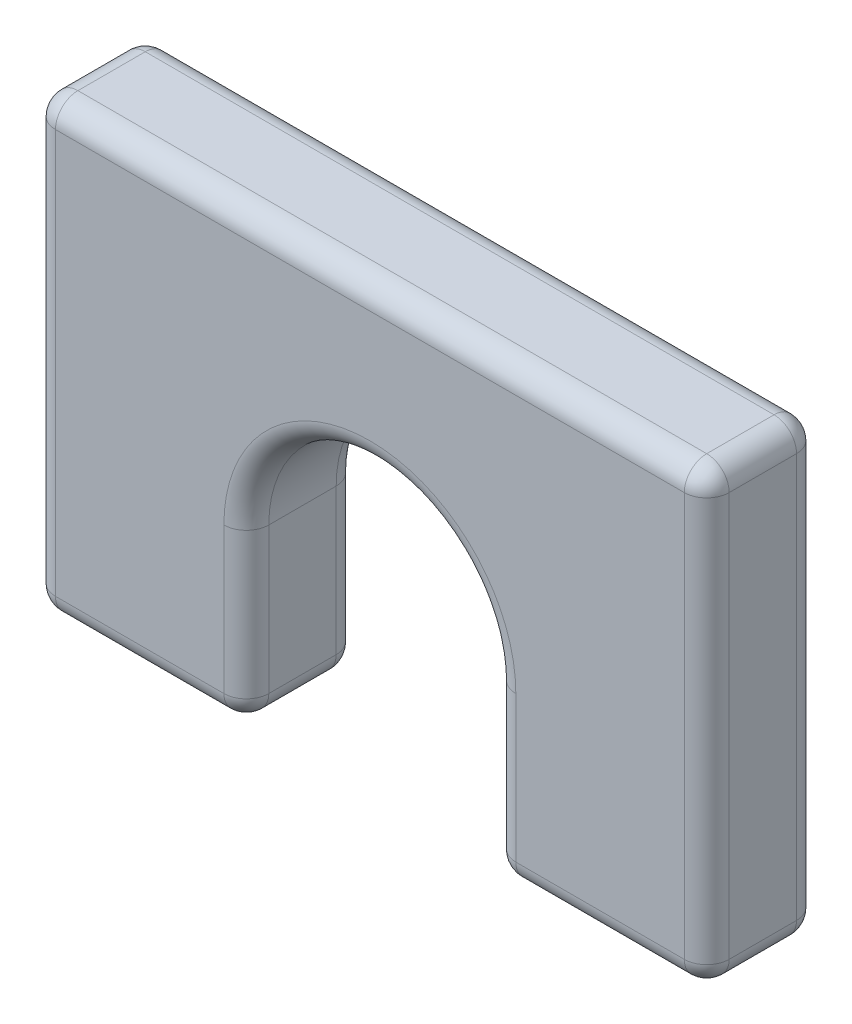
ISO-10303-21;
HEADER;
FILE_DESCRIPTION(('STEP AP214'),'2;1');
FILE_NAME('part.step','',(''),(''),'','','');
FILE_SCHEMA(('AUTOMOTIVE_DESIGN { 1 0 10303 214 1 1 1 1 }'));
ENDSEC;
DATA;
#1=APPLICATION_CONTEXT('core data for automotive mechanical design processes');
#2=APPLICATION_PROTOCOL_DEFINITION('international standard','automotive_design',2000,#1);
#3=PRODUCT_CONTEXT('',#1,'mechanical');
#4=PRODUCT('Part','Part','',(#3));
#5=PRODUCT_RELATED_PRODUCT_CATEGORY('part','',(#4));
#6=PRODUCT_DEFINITION_FORMATION('','',#4);
#7=PRODUCT_DEFINITION_CONTEXT('part definition',#1,'design');
#8=PRODUCT_DEFINITION('design','',#6,#7);
#9=PRODUCT_DEFINITION_SHAPE('','',#8);
#10=(LENGTH_UNIT() NAMED_UNIT(*) SI_UNIT(.MILLI.,.METRE.));
#11=(NAMED_UNIT(*) PLANE_ANGLE_UNIT() SI_UNIT($,.RADIAN.));
#12=(NAMED_UNIT(*) SI_UNIT($,.STERADIAN.) SOLID_ANGLE_UNIT());
#13=UNCERTAINTY_MEASURE_WITH_UNIT(LENGTH_MEASURE(1.E-05),#10,'distance_accuracy_value','');
#14=(GEOMETRIC_REPRESENTATION_CONTEXT(3) GLOBAL_UNCERTAINTY_ASSIGNED_CONTEXT((#13)) GLOBAL_UNIT_ASSIGNED_CONTEXT((#10,
#11,#12)) REPRESENTATION_CONTEXT('',''));
#15=CARTESIAN_POINT('',(0.,0.,0.));
#16=DIRECTION('',(0.,0.,1.));
#17=DIRECTION('',(1.,0.,0.));
#18=AXIS2_PLACEMENT_3D('',#15,#16,#17);
#19=CARTESIAN_POINT('',(6.5,-9.00000000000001,4.));
#20=DIRECTION('',(1.,0.,0.));
#21=DIRECTION('',(0.,0.,-1.));
#22=AXIS2_PLACEMENT_3D('',#19,#20,#21);
#23=SPHERICAL_SURFACE('',#22,1.);
#24=CARTESIAN_POINT('',(6.5,-9.00000000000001,4.));
#25=DIRECTION('',(0.,0.,1.));
#26=DIRECTION('',(1.,0.,0.));
#27=AXIS2_PLACEMENT_3D('',#24,#25,#26);
#28=CIRCLE('',#27,1.);
#29=CARTESIAN_POINT('',(6.5,-10.,4.));
#30=VERTEX_POINT('',#29);
#31=CARTESIAN_POINT('',(5.5,-9.00000000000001,4.));
#32=VERTEX_POINT('',#31);
#33=EDGE_CURVE('E674',#30,#32,#28,.F.);
#34=ORIENTED_EDGE('',*,*,#33,.F.);
#35=CARTESIAN_POINT('',(6.5,-9.00000000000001,4.));
#36=DIRECTION('',(-1.,0.,0.));
#37=DIRECTION('',(0.,0.,1.));
#38=AXIS2_PLACEMENT_3D('',#35,#36,#37);
#39=CIRCLE('',#38,1.);
#40=CARTESIAN_POINT('',(6.5,-9.00000000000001,5.));
#41=VERTEX_POINT('',#40);
#42=EDGE_CURVE('E662',#41,#30,#39,.F.);
#43=ORIENTED_EDGE('',*,*,#42,.F.);
#44=CARTESIAN_POINT('',(6.5,-9.00000000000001,4.));
#45=DIRECTION('',(0.,-1.,0.));
#46=DIRECTION('',(0.,0.,-1.));
#47=AXIS2_PLACEMENT_3D('',#44,#45,#46);
#48=CIRCLE('',#47,1.);
#49=EDGE_CURVE('E640',#32,#41,#48,.F.);
#50=ORIENTED_EDGE('',*,*,#49,.F.);
#51=EDGE_LOOP('',(#34,#43,#50));
#52=FACE_BOUND('',#51,.T.);
#53=ADVANCED_FACE('F17',(#52),#23,.T.);
#54=CARTESIAN_POINT('',(14.,-9.00000000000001,4.));
#55=DIRECTION('',(1.,0.,0.));
#56=DIRECTION('',(0.,0.,-1.));
#57=AXIS2_PLACEMENT_3D('',#54,#55,#56);
#58=SPHERICAL_SURFACE('',#57,1.);
#59=CARTESIAN_POINT('',(14.,-9.00000000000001,4.));
#60=DIRECTION('',(0.,0.,-1.));
#61=DIRECTION('',(-1.,0.,0.));
#62=AXIS2_PLACEMENT_3D('',#59,#60,#61);
#63=CIRCLE('',#62,1.);
#64=CARTESIAN_POINT('',(15.,-9.00000000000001,4.));
#65=VERTEX_POINT('',#64);
#66=CARTESIAN_POINT('',(14.,-10.,4.));
#67=VERTEX_POINT('',#66);
#68=EDGE_CURVE('E694',#65,#67,#63,.T.);
#69=ORIENTED_EDGE('',*,*,#68,.F.);
#70=CARTESIAN_POINT('',(14.,-9.00000000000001,4.));
#71=DIRECTION('',(0.,-1.,0.));
#72=DIRECTION('',(0.,0.,-1.));
#73=AXIS2_PLACEMENT_3D('',#70,#71,#72);
#74=CIRCLE('',#73,1.);
#75=CARTESIAN_POINT('',(14.,-9.00000000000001,5.));
#76=VERTEX_POINT('',#75);
#77=EDGE_CURVE('E677',#76,#65,#74,.F.);
#78=ORIENTED_EDGE('',*,*,#77,.F.);
#79=CARTESIAN_POINT('',(14.,-9.00000000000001,4.));
#80=DIRECTION('',(-1.,0.,0.));
#81=DIRECTION('',(0.,0.,1.));
#82=AXIS2_PLACEMENT_3D('',#79,#80,#81);
#83=CIRCLE('',#82,1.);
#84=EDGE_CURVE('E658',#67,#76,#83,.T.);
#85=ORIENTED_EDGE('',*,*,#84,.F.);
#86=EDGE_LOOP('',(#69,#78,#85));
#87=FACE_BOUND('',#86,.T.);
#88=ADVANCED_FACE('F263',(#87),#58,.T.);
#89=CARTESIAN_POINT('',(14.,9.00000000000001,4.));
#90=DIRECTION('',(1.,0.,0.));
#91=DIRECTION('',(0.,0.,-1.));
#92=AXIS2_PLACEMENT_3D('',#89,#90,#91);
#93=SPHERICAL_SURFACE('',#92,1.);
#94=CARTESIAN_POINT('',(14.,9.00000000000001,4.));
#95=DIRECTION('',(0.,0.,-1.));
#96=DIRECTION('',(-1.,0.,0.));
#97=AXIS2_PLACEMENT_3D('',#94,#95,#96);
#98=CIRCLE('',#97,1.);
#99=CARTESIAN_POINT('',(14.,10.,4.));
#100=VERTEX_POINT('',#99);
#101=CARTESIAN_POINT('',(15.,9.00000000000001,4.));
#102=VERTEX_POINT('',#101);
#103=EDGE_CURVE('E697',#100,#102,#98,.T.);
#104=ORIENTED_EDGE('',*,*,#103,.F.);
#105=CARTESIAN_POINT('',(14.,9.00000000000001,4.));
#106=DIRECTION('',(1.,0.,0.));
#107=DIRECTION('',(0.,1.,0.));
#108=AXIS2_PLACEMENT_3D('',#105,#106,#107);
#109=CIRCLE('',#108,1.);
#110=CARTESIAN_POINT('',(14.,9.00000000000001,5.));
#111=VERTEX_POINT('',#110);
#112=EDGE_CURVE('E702',#111,#100,#109,.F.);
#113=ORIENTED_EDGE('',*,*,#112,.F.);
#114=CARTESIAN_POINT('',(14.,9.00000000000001,4.));
#115=DIRECTION('',(0.,-1.,0.));
#116=DIRECTION('',(0.,0.,-1.));
#117=AXIS2_PLACEMENT_3D('',#114,#115,#116);
#118=CIRCLE('',#117,1.);
#119=EDGE_CURVE('E680',#102,#111,#118,.T.);
#120=ORIENTED_EDGE('',*,*,#119,.F.);
#121=EDGE_LOOP('',(#104,#113,#120));
#122=FACE_BOUND('',#121,.T.);
#123=ADVANCED_FACE('F235',(#122),#93,.T.);
#124=CARTESIAN_POINT('',(-14.,9.,4.));
#125=DIRECTION('',(1.,0.,0.));
#126=DIRECTION('',(0.,0.,-1.));
#127=AXIS2_PLACEMENT_3D('',#124,#125,#126);
#128=SPHERICAL_SURFACE('',#127,1.);
#129=CARTESIAN_POINT('',(-14.,9.,4.));
#130=DIRECTION('',(1.,0.,0.));
#131=DIRECTION('',(0.,1.,0.));
#132=AXIS2_PLACEMENT_3D('',#129,#130,#131);
#133=CIRCLE('',#132,1.);
#134=CARTESIAN_POINT('',(-14.,10.,4.));
#135=VERTEX_POINT('',#134);
#136=CARTESIAN_POINT('',(-14.,9.,5.));
#137=VERTEX_POINT('',#136);
#138=EDGE_CURVE('E255',#135,#137,#133,.T.);
#139=ORIENTED_EDGE('',*,*,#138,.F.);
#140=CARTESIAN_POINT('',(-14.,9.,4.));
#141=DIRECTION('',(0.,0.,-1.));
#142=DIRECTION('',(-1.,0.,0.));
#143=AXIS2_PLACEMENT_3D('',#140,#141,#142);
#144=CIRCLE('',#143,1.);
#145=CARTESIAN_POINT('',(-15.,9.,4.));
#146=VERTEX_POINT('',#145);
#147=EDGE_CURVE('E254',#146,#135,#144,.T.);
#148=ORIENTED_EDGE('',*,*,#147,.F.);
#149=CARTESIAN_POINT('',(-14.,9.,4.));
#150=DIRECTION('',(0.,1.,0.));
#151=DIRECTION('',(0.,0.,1.));
#152=AXIS2_PLACEMENT_3D('',#149,#150,#151);
#153=CIRCLE('',#152,1.);
#154=EDGE_CURVE('E246',#137,#146,#153,.F.);
#155=ORIENTED_EDGE('',*,*,#154,.F.);
#156=EDGE_LOOP('',(#139,#148,#155));
#157=FACE_BOUND('',#156,.T.);
#158=ADVANCED_FACE('F230',(#157),#128,.T.);
#159=CARTESIAN_POINT('',(-14.,-9.00000000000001,4.));
#160=DIRECTION('',(1.,0.,0.));
#161=DIRECTION('',(0.,0.,-1.));
#162=AXIS2_PLACEMENT_3D('',#159,#160,#161);
#163=SPHERICAL_SURFACE('',#162,1.);
#164=CARTESIAN_POINT('',(-14.,-9.00000000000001,4.));
#165=DIRECTION('',(-1.,0.,0.));
#166=DIRECTION('',(0.,0.,1.));
#167=AXIS2_PLACEMENT_3D('',#164,#165,#166);
#168=CIRCLE('',#167,1.);
#169=CARTESIAN_POINT('',(-14.,-9.00000000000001,5.));
#170=VERTEX_POINT('',#169);
#171=CARTESIAN_POINT('',(-14.,-10.,4.));
#172=VERTEX_POINT('',#171);
#173=EDGE_CURVE('E747',#170,#172,#168,.F.);
#174=ORIENTED_EDGE('',*,*,#173,.F.);
#175=CARTESIAN_POINT('',(-14.,-9.00000000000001,4.));
#176=DIRECTION('',(0.,1.,0.));
#177=DIRECTION('',(0.,0.,1.));
#178=AXIS2_PLACEMENT_3D('',#175,#176,#177);
#179=CIRCLE('',#178,1.);
#180=CARTESIAN_POINT('',(-15.,-9.00000000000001,4.));
#181=VERTEX_POINT('',#180);
#182=EDGE_CURVE('E247',#181,#170,#179,.T.);
#183=ORIENTED_EDGE('',*,*,#182,.F.);
#184=CARTESIAN_POINT('',(-14.,-9.00000000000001,4.));
#185=DIRECTION('',(0.,0.,-1.));
#186=DIRECTION('',(-1.,0.,0.));
#187=AXIS2_PLACEMENT_3D('',#184,#185,#186);
#188=CIRCLE('',#187,1.);
#189=EDGE_CURVE('E190',#172,#181,#188,.T.);
#190=ORIENTED_EDGE('',*,*,#189,.F.);
#191=EDGE_LOOP('',(#174,#183,#190));
#192=FACE_BOUND('',#191,.T.);
#193=ADVANCED_FACE('F227',(#192),#163,.T.);
#194=CARTESIAN_POINT('',(-15.,10.,5.));
#195=DIRECTION('',(0.,0.,1.));
#196=DIRECTION('',(1.,0.,0.));
#197=AXIS2_PLACEMENT_3D('',#194,#195,#196);
#198=PLANE('',#197);
#199=DIRECTION('',(0.,-1.,0.));
#200=VECTOR('',#199,1.);
#201=CARTESIAN_POINT('',(14.,10.,5.));
#202=LINE('',#201,#200);
#203=EDGE_CURVE('E261',#111,#76,#202,.T.);
#204=ORIENTED_EDGE('',*,*,#203,.F.);
#205=DIRECTION('',(1.,0.,0.));
#206=VECTOR('',#205,1.);
#207=CARTESIAN_POINT('',(-15.,9.,5.));
#208=LINE('',#207,#206);
#209=EDGE_CURVE('E250',#137,#111,#208,.T.);
#210=ORIENTED_EDGE('',*,*,#209,.F.);
#211=DIRECTION('',(0.,1.,0.));
#212=VECTOR('',#211,1.);
#213=CARTESIAN_POINT('',(-14.,10.,5.));
#214=LINE('',#213,#212);
#215=EDGE_CURVE('E242',#170,#137,#214,.T.);
#216=ORIENTED_EDGE('',*,*,#215,.F.);
#217=DIRECTION('',(-1.,0.,0.));
#218=VECTOR('',#217,1.);
#219=CARTESIAN_POINT('',(-15.,-9.00000000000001,5.));
#220=LINE('',#219,#218);
#221=CARTESIAN_POINT('',(-6.5,-9.00000000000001,5.));
#222=VERTEX_POINT('',#221);
#223=EDGE_CURVE('E196',#222,#170,#220,.T.);
#224=ORIENTED_EDGE('',*,*,#223,.F.);
#225=DIRECTION('',(0.,1.,0.));
#226=VECTOR('',#225,1.);
#227=CARTESIAN_POINT('',(-6.5,-2.50000000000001,5.));
#228=LINE('',#227,#226);
#229=CARTESIAN_POINT('',(-6.5,-2.50000000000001,5.));
#230=VERTEX_POINT('',#229);
#231=EDGE_CURVE('E185',#230,#222,#228,.F.);
#232=ORIENTED_EDGE('',*,*,#231,.F.);
#233=CARTESIAN_POINT('',(0.,-2.50000000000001,5.));
#234=DIRECTION('',(0.,0.,1.));
#235=DIRECTION('',(1.,0.,0.));
#236=AXIS2_PLACEMENT_3D('',#233,#234,#235);
#237=CIRCLE('',#236,6.5);
#238=CARTESIAN_POINT('',(6.5,-2.50000000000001,5.));
#239=VERTEX_POINT('',#238);
#240=EDGE_CURVE('E167',#239,#230,#237,.T.);
#241=ORIENTED_EDGE('',*,*,#240,.F.);
#242=DIRECTION('',(0.,-1.,0.));
#243=VECTOR('',#242,1.);
#244=CARTESIAN_POINT('',(6.5,-2.50000000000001,5.));
#245=LINE('',#244,#243);
#246=EDGE_CURVE('E643',#41,#239,#245,.F.);
#247=ORIENTED_EDGE('',*,*,#246,.F.);
#248=DIRECTION('',(-1.,0.,0.));
#249=VECTOR('',#248,1.);
#250=CARTESIAN_POINT('',(-15.,-9.00000000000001,5.));
#251=LINE('',#250,#249);
#252=EDGE_CURVE('E661',#76,#41,#251,.T.);
#253=ORIENTED_EDGE('',*,*,#252,.F.);
#254=EDGE_LOOP('',(#204,#210,#216,#224,#232,#241,#247,#253));
#255=FACE_BOUND('',#254,.T.);
#256=ADVANCED_FACE('F193',(#255),#198,.T.);
#257=CARTESIAN_POINT('',(-6.5,-9.00000000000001,4.));
#258=DIRECTION('',(1.,0.,0.));
#259=DIRECTION('',(0.,0.,-1.));
#260=AXIS2_PLACEMENT_3D('',#257,#258,#259);
#261=SPHERICAL_SURFACE('',#260,1.);
#262=CARTESIAN_POINT('',(-6.5,-9.00000000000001,4.));
#263=DIRECTION('',(0.,1.,0.));
#264=DIRECTION('',(0.,0.,1.));
#265=AXIS2_PLACEMENT_3D('',#262,#263,#264);
#266=CIRCLE('',#265,1.);
#267=CARTESIAN_POINT('',(-5.5,-9.00000000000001,4.));
#268=VERTEX_POINT('',#267);
#269=EDGE_CURVE('E198',#222,#268,#266,.T.);
#270=ORIENTED_EDGE('',*,*,#269,.F.);
#271=CARTESIAN_POINT('',(-6.5,-9.00000000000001,4.));
#272=DIRECTION('',(-1.,0.,0.));
#273=DIRECTION('',(0.,0.,1.));
#274=AXIS2_PLACEMENT_3D('',#271,#272,#273);
#275=CIRCLE('',#274,1.);
#276=CARTESIAN_POINT('',(-6.5,-10.,4.));
#277=VERTEX_POINT('',#276);
#278=EDGE_CURVE('E726',#277,#222,#275,.T.);
#279=ORIENTED_EDGE('',*,*,#278,.F.);
#280=CARTESIAN_POINT('',(-6.5,-9.00000000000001,4.));
#281=DIRECTION('',(0.,0.,1.));
#282=DIRECTION('',(1.,0.,0.));
#283=AXIS2_PLACEMENT_3D('',#280,#281,#282);
#284=CIRCLE('',#283,1.);
#285=EDGE_CURVE('E773',#268,#277,#284,.F.);
#286=ORIENTED_EDGE('',*,*,#285,.F.);
#287=EDGE_LOOP('',(#270,#279,#286));
#288=FACE_BOUND('',#287,.T.);
#289=ADVANCED_FACE('F226',(#288),#261,.T.);
#290=CARTESIAN_POINT('',(0.,-2.50000000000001,4.));
#291=DIRECTION('',(0.,0.,1.));
#292=DIRECTION('',(1.,0.,0.));
#293=AXIS2_PLACEMENT_3D('',#290,#291,#292);
#294=TOROIDAL_SURFACE('',#293,6.5,1.);
#295=CARTESIAN_POINT('',(-6.5,-2.50000000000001,4.));
#296=DIRECTION('',(0.,1.,0.));
#297=DIRECTION('',(0.,0.,1.));
#298=AXIS2_PLACEMENT_3D('',#295,#296,#297);
#299=CIRCLE('',#298,1.);
#300=CARTESIAN_POINT('',(-5.5,-2.50000000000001,4.));
#301=VERTEX_POINT('',#300);
#302=EDGE_CURVE('E171',#301,#230,#299,.F.);
#303=ORIENTED_EDGE('',*,*,#302,.F.);
#304=CARTESIAN_POINT('',(0.,-2.50000000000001,4.));
#305=DIRECTION('',(0.,0.,1.));
#306=DIRECTION('',(1.,0.,0.));
#307=AXIS2_PLACEMENT_3D('',#304,#305,#306);
#308=CIRCLE('',#307,5.5);
#309=CARTESIAN_POINT('',(5.5,-2.50000000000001,4.));
#310=VERTEX_POINT('',#309);
#311=EDGE_CURVE('E655',#301,#310,#308,.F.);
#312=ORIENTED_EDGE('',*,*,#311,.T.);
#313=CARTESIAN_POINT('',(6.5,-2.50000000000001,4.));
#314=DIRECTION('',(0.,-1.,0.));
#315=DIRECTION('',(0.,0.,-1.));
#316=AXIS2_PLACEMENT_3D('',#313,#314,#315);
#317=CIRCLE('',#316,1.);
#318=EDGE_CURVE('E173',#239,#310,#317,.T.);
#319=ORIENTED_EDGE('',*,*,#318,.F.);
#320=ORIENTED_EDGE('',*,*,#240,.T.);
#321=EDGE_LOOP('',(#303,#312,#319,#320));
#322=FACE_BOUND('',#321,.T.);
#323=ADVANCED_FACE('F169',(#322),#294,.T.);
#324=CARTESIAN_POINT('',(6.5,-2.50000000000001,4.));
#325=DIRECTION('',(0.,-1.,0.));
#326=DIRECTION('',(0.,0.,-1.));
#327=AXIS2_PLACEMENT_3D('',#324,#325,#326);
#328=CYLINDRICAL_SURFACE('',#327,1.);
#329=ORIENTED_EDGE('',*,*,#49,.T.);
#330=ORIENTED_EDGE('',*,*,#246,.T.);
#331=ORIENTED_EDGE('',*,*,#318,.T.);
#332=DIRECTION('',(0.,1.,0.));
#333=VECTOR('',#332,1.);
#334=CARTESIAN_POINT('',(5.5,-2.50000000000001,4.));
#335=LINE('',#334,#333);
#336=EDGE_CURVE('E650',#310,#32,#335,.F.);
#337=ORIENTED_EDGE('',*,*,#336,.T.);
#338=EDGE_LOOP('',(#329,#330,#331,#337));
#339=FACE_BOUND('',#338,.T.);
#340=ADVANCED_FACE('F630',(#339),#328,.T.);
#341=CARTESIAN_POINT('',(-15.,-9.00000000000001,4.));
#342=DIRECTION('',(-1.,0.,0.));
#343=DIRECTION('',(0.,0.,1.));
#344=AXIS2_PLACEMENT_3D('',#341,#342,#343);
#345=CYLINDRICAL_SURFACE('',#344,1.);
#346=ORIENTED_EDGE('',*,*,#84,.T.);
#347=ORIENTED_EDGE('',*,*,#252,.T.);
#348=ORIENTED_EDGE('',*,*,#42,.T.);
#349=DIRECTION('',(1.,0.,0.));
#350=VECTOR('',#349,1.);
#351=CARTESIAN_POINT('',(15.,-10.,4.));
#352=LINE('',#351,#350);
#353=EDGE_CURVE('E561',#30,#67,#352,.T.);
#354=ORIENTED_EDGE('',*,*,#353,.T.);
#355=EDGE_LOOP('',(#346,#347,#348,#354));
#356=FACE_BOUND('',#355,.T.);
#357=ADVANCED_FACE('F626',(#356),#345,.T.);
#358=CARTESIAN_POINT('',(6.5,-9.00000000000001,0.));
#359=DIRECTION('',(0.,0.,1.));
#360=DIRECTION('',(1.,0.,0.));
#361=AXIS2_PLACEMENT_3D('',#358,#359,#360);
#362=CYLINDRICAL_SURFACE('',#361,1.);
#363=CARTESIAN_POINT('',(6.5,-9.00000000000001,1.));
#364=DIRECTION('',(0.,0.,-1.));
#365=DIRECTION('',(1.,0.,0.));
#366=AXIS2_PLACEMENT_3D('',#363,#364,#365);
#367=CIRCLE('',#366,1.);
#368=CARTESIAN_POINT('',(6.5,-10.,1.));
#369=VERTEX_POINT('',#368);
#370=CARTESIAN_POINT('',(5.5,-9.00000000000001,1.));
#371=VERTEX_POINT('',#370);
#372=EDGE_CURVE('E571',#369,#371,#367,.T.);
#373=ORIENTED_EDGE('',*,*,#372,.F.);
#374=DIRECTION('',(0.,0.,1.));
#375=VECTOR('',#374,1.);
#376=CARTESIAN_POINT('',(6.5,-10.,5.));
#377=LINE('',#376,#375);
#378=EDGE_CURVE('E547',#369,#30,#377,.T.);
#379=ORIENTED_EDGE('',*,*,#378,.T.);
#380=ORIENTED_EDGE('',*,*,#33,.T.);
#381=DIRECTION('',(0.,0.,-1.));
#382=VECTOR('',#381,1.);
#383=CARTESIAN_POINT('',(5.5,-9.00000000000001,0.));
#384=LINE('',#383,#382);
#385=EDGE_CURVE('E654',#32,#371,#384,.T.);
#386=ORIENTED_EDGE('',*,*,#385,.T.);
#387=EDGE_LOOP('',(#373,#379,#380,#386));
#388=FACE_BOUND('',#387,.T.);
#389=ADVANCED_FACE('F622',(#388),#362,.T.);
#390=CARTESIAN_POINT('',(14.,10.,4.));
#391=DIRECTION('',(0.,-1.,0.));
#392=DIRECTION('',(0.,0.,-1.));
#393=AXIS2_PLACEMENT_3D('',#390,#391,#392);
#394=CYLINDRICAL_SURFACE('',#393,1.);
#395=ORIENTED_EDGE('',*,*,#119,.T.);
#396=ORIENTED_EDGE('',*,*,#203,.T.);
#397=ORIENTED_EDGE('',*,*,#77,.T.);
#398=DIRECTION('',(0.,1.,0.));
#399=VECTOR('',#398,1.);
#400=CARTESIAN_POINT('',(15.,-10.,4.));
#401=LINE('',#400,#399);
#402=EDGE_CURVE('E546',#65,#102,#401,.T.);
#403=ORIENTED_EDGE('',*,*,#402,.T.);
#404=EDGE_LOOP('',(#395,#396,#397,#403));
#405=FACE_BOUND('',#404,.T.);
#406=ADVANCED_FACE('F618',(#405),#394,.T.);
#407=CARTESIAN_POINT('',(14.,-9.00000000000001,5.));
#408=DIRECTION('',(0.,0.,-1.));
#409=DIRECTION('',(-1.,0.,0.));
#410=AXIS2_PLACEMENT_3D('',#407,#408,#409);
#411=CYLINDRICAL_SURFACE('',#410,1.);
#412=CARTESIAN_POINT('',(14.,-9.00000000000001,1.));
#413=DIRECTION('',(0.,0.,-1.));
#414=DIRECTION('',(1.,0.,0.));
#415=AXIS2_PLACEMENT_3D('',#412,#413,#414);
#416=CIRCLE('',#415,1.);
#417=CARTESIAN_POINT('',(15.,-9.00000000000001,1.));
#418=VERTEX_POINT('',#417);
#419=CARTESIAN_POINT('',(14.,-10.,1.));
#420=VERTEX_POINT('',#419);
#421=EDGE_CURVE('E543',#418,#420,#416,.T.);
#422=ORIENTED_EDGE('',*,*,#421,.F.);
#423=DIRECTION('',(0.,0.,1.));
#424=VECTOR('',#423,1.);
#425=CARTESIAN_POINT('',(15.,-9.00000000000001,5.));
#426=LINE('',#425,#424);
#427=EDGE_CURVE('E550',#418,#65,#426,.T.);
#428=ORIENTED_EDGE('',*,*,#427,.T.);
#429=ORIENTED_EDGE('',*,*,#68,.T.);
#430=DIRECTION('',(0.,0.,1.));
#431=VECTOR('',#430,1.);
#432=CARTESIAN_POINT('',(14.,-10.,5.));
#433=LINE('',#432,#431);
#434=EDGE_CURVE('E557',#67,#420,#433,.F.);
#435=ORIENTED_EDGE('',*,*,#434,.T.);
#436=EDGE_LOOP('',(#422,#428,#429,#435));
#437=FACE_BOUND('',#436,.T.);
#438=ADVANCED_FACE('F614',(#437),#411,.T.);
#439=CARTESIAN_POINT('',(14.,9.00000000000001,5.));
#440=DIRECTION('',(0.,0.,-1.));
#441=DIRECTION('',(-1.,0.,0.));
#442=AXIS2_PLACEMENT_3D('',#439,#440,#441);
#443=CYLINDRICAL_SURFACE('',#442,1.);
#444=CARTESIAN_POINT('',(14.,9.00000000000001,0.999999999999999));
#445=DIRECTION('',(0.,0.,1.));
#446=DIRECTION('',(1.,0.,0.));
#447=AXIS2_PLACEMENT_3D('',#444,#445,#446);
#448=CIRCLE('',#447,1.);
#449=CARTESIAN_POINT('',(14.,10.,1.));
#450=VERTEX_POINT('',#449);
#451=CARTESIAN_POINT('',(15.,9.00000000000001,1.));
#452=VERTEX_POINT('',#451);
#453=EDGE_CURVE('E519',#450,#452,#448,.F.);
#454=ORIENTED_EDGE('',*,*,#453,.F.);
#455=DIRECTION('',(0.,0.,1.));
#456=VECTOR('',#455,1.);
#457=CARTESIAN_POINT('',(14.,10.,5.));
#458=LINE('',#457,#456);
#459=EDGE_CURVE('E716',#450,#100,#458,.T.);
#460=ORIENTED_EDGE('',*,*,#459,.T.);
#461=ORIENTED_EDGE('',*,*,#103,.T.);
#462=DIRECTION('',(0.,0.,1.));
#463=VECTOR('',#462,1.);
#464=CARTESIAN_POINT('',(15.,9.00000000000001,5.));
#465=LINE('',#464,#463);
#466=EDGE_CURVE('E554',#102,#452,#465,.F.);
#467=ORIENTED_EDGE('',*,*,#466,.T.);
#468=EDGE_LOOP('',(#454,#460,#461,#467));
#469=FACE_BOUND('',#468,.T.);
#470=ADVANCED_FACE('F610',(#469),#443,.T.);
#471=CARTESIAN_POINT('',(-15.,9.,4.));
#472=DIRECTION('',(1.,0.,0.));
#473=DIRECTION('',(0.,1.,0.));
#474=AXIS2_PLACEMENT_3D('',#471,#472,#473);
#475=CYLINDRICAL_SURFACE('',#474,1.);
#476=ORIENTED_EDGE('',*,*,#138,.T.);
#477=ORIENTED_EDGE('',*,*,#209,.T.);
#478=ORIENTED_EDGE('',*,*,#112,.T.);
#479=DIRECTION('',(1.,0.,0.));
#480=VECTOR('',#479,1.);
#481=CARTESIAN_POINT('',(15.,10.,4.));
#482=LINE('',#481,#480);
#483=EDGE_CURVE('E509',#100,#135,#482,.F.);
#484=ORIENTED_EDGE('',*,*,#483,.T.);
#485=EDGE_LOOP('',(#476,#477,#478,#484));
#486=FACE_BOUND('',#485,.T.);
#487=ADVANCED_FACE('F606',(#486),#475,.T.);
#488=CARTESIAN_POINT('',(-14.,9.,5.));
#489=DIRECTION('',(0.,0.,-1.));
#490=DIRECTION('',(-1.,0.,0.));
#491=AXIS2_PLACEMENT_3D('',#488,#489,#490);
#492=CYLINDRICAL_SURFACE('',#491,1.);
#493=CARTESIAN_POINT('',(-14.,9.,1.));
#494=DIRECTION('',(0.,0.,-1.));
#495=DIRECTION('',(-1.,0.,0.));
#496=AXIS2_PLACEMENT_3D('',#493,#494,#495);
#497=CIRCLE('',#496,1.);
#498=CARTESIAN_POINT('',(-14.,10.,1.00000000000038));
#499=VERTEX_POINT('',#498);
#500=CARTESIAN_POINT('',(-15.,9.,1.));
#501=VERTEX_POINT('',#500);
#502=EDGE_CURVE('E721',#499,#501,#497,.F.);
#503=ORIENTED_EDGE('',*,*,#502,.T.);
#504=DIRECTION('',(0.,0.,-1.));
#505=VECTOR('',#504,1.);
#506=CARTESIAN_POINT('',(-15.,9.,5.));
#507=LINE('',#506,#505);
#508=EDGE_CURVE('E492',#501,#146,#507,.F.);
#509=ORIENTED_EDGE('',*,*,#508,.T.);
#510=ORIENTED_EDGE('',*,*,#147,.T.);
#511=DIRECTION('',(0.,0.,1.));
#512=VECTOR('',#511,1.);
#513=CARTESIAN_POINT('',(-14.,10.,5.));
#514=LINE('',#513,#512);
#515=EDGE_CURVE('E503',#135,#499,#514,.F.);
#516=ORIENTED_EDGE('',*,*,#515,.T.);
#517=EDGE_LOOP('',(#503,#509,#510,#516));
#518=FACE_BOUND('',#517,.T.);
#519=ADVANCED_FACE('F602',(#518),#492,.T.);
#520=CARTESIAN_POINT('',(-14.,10.,4.));
#521=DIRECTION('',(0.,1.,0.));
#522=DIRECTION('',(0.,0.,1.));
#523=AXIS2_PLACEMENT_3D('',#520,#521,#522);
#524=CYLINDRICAL_SURFACE('',#523,1.);
#525=ORIENTED_EDGE('',*,*,#154,.T.);
#526=DIRECTION('',(0.,1.,0.));
#527=VECTOR('',#526,1.);
#528=CARTESIAN_POINT('',(-15.,-10.,4.));
#529=LINE('',#528,#527);
#530=EDGE_CURVE('E496',#146,#181,#529,.F.);
#531=ORIENTED_EDGE('',*,*,#530,.T.);
#532=ORIENTED_EDGE('',*,*,#182,.T.);
#533=ORIENTED_EDGE('',*,*,#215,.T.);
#534=EDGE_LOOP('',(#525,#531,#532,#533));
#535=FACE_BOUND('',#534,.T.);
#536=ADVANCED_FACE('F598',(#535),#524,.T.);
#537=CARTESIAN_POINT('',(-15.,-9.00000000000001,4.));
#538=DIRECTION('',(-1.,0.,0.));
#539=DIRECTION('',(0.,0.,1.));
#540=AXIS2_PLACEMENT_3D('',#537,#538,#539);
#541=CYLINDRICAL_SURFACE('',#540,1.);
#542=ORIENTED_EDGE('',*,*,#173,.T.);
#543=DIRECTION('',(1.,0.,0.));
#544=VECTOR('',#543,1.);
#545=CARTESIAN_POINT('',(15.,-10.,4.));
#546=LINE('',#545,#544);
#547=EDGE_CURVE('E732',#172,#277,#546,.T.);
#548=ORIENTED_EDGE('',*,*,#547,.T.);
#549=ORIENTED_EDGE('',*,*,#278,.T.);
#550=ORIENTED_EDGE('',*,*,#223,.T.);
#551=EDGE_LOOP('',(#542,#548,#549,#550));
#552=FACE_BOUND('',#551,.T.);
#553=ADVANCED_FACE('F594',(#552),#541,.T.);
#554=CARTESIAN_POINT('',(-14.,-9.00000000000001,5.));
#555=DIRECTION('',(0.,0.,-1.));
#556=DIRECTION('',(-1.,0.,0.));
#557=AXIS2_PLACEMENT_3D('',#554,#555,#556);
#558=CYLINDRICAL_SURFACE('',#557,1.);
#559=ORIENTED_EDGE('',*,*,#189,.T.);
#560=DIRECTION('',(0.,0.,-1.));
#561=VECTOR('',#560,1.);
#562=CARTESIAN_POINT('',(-15.,-9.00000000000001,5.));
#563=LINE('',#562,#561);
#564=CARTESIAN_POINT('',(-15.,-9.00000000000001,1.));
#565=VERTEX_POINT('',#564);
#566=EDGE_CURVE('E497',#181,#565,#563,.T.);
#567=ORIENTED_EDGE('',*,*,#566,.T.);
#568=CARTESIAN_POINT('',(-14.,-9.00000000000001,1.));
#569=DIRECTION('',(0.,0.,-1.));
#570=DIRECTION('',(-1.,0.,0.));
#571=AXIS2_PLACEMENT_3D('',#568,#569,#570);
#572=CIRCLE('',#571,1.);
#573=CARTESIAN_POINT('',(-14.,-10.,1.));
#574=VERTEX_POINT('',#573);
#575=EDGE_CURVE('E750',#565,#574,#572,.F.);
#576=ORIENTED_EDGE('',*,*,#575,.T.);
#577=DIRECTION('',(0.,0.,1.));
#578=VECTOR('',#577,1.);
#579=CARTESIAN_POINT('',(-14.,-10.,5.));
#580=LINE('',#579,#578);
#581=EDGE_CURVE('E778',#574,#172,#580,.T.);
#582=ORIENTED_EDGE('',*,*,#581,.T.);
#583=EDGE_LOOP('',(#559,#567,#576,#582));
#584=FACE_BOUND('',#583,.T.);
#585=ADVANCED_FACE('F591',(#584),#558,.T.);
#586=CARTESIAN_POINT('',(-6.5,-2.50000000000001,4.));
#587=DIRECTION('',(0.,1.,0.));
#588=DIRECTION('',(0.,0.,1.));
#589=AXIS2_PLACEMENT_3D('',#586,#587,#588);
#590=CYLINDRICAL_SURFACE('',#589,1.);
#591=ORIENTED_EDGE('',*,*,#269,.T.);
#592=DIRECTION('',(0.,1.,0.));
#593=VECTOR('',#592,1.);
#594=CARTESIAN_POINT('',(-5.5,-2.50000000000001,4.));
#595=LINE('',#594,#593);
#596=EDGE_CURVE('E188',#268,#301,#595,.T.);
#597=ORIENTED_EDGE('',*,*,#596,.T.);
#598=ORIENTED_EDGE('',*,*,#302,.T.);
#599=ORIENTED_EDGE('',*,*,#231,.T.);
#600=EDGE_LOOP('',(#591,#597,#598,#599));
#601=FACE_BOUND('',#600,.T.);
#602=ADVANCED_FACE('F184',(#601),#590,.T.);
#603=CARTESIAN_POINT('',(-6.5,-9.00000000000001,5.));
#604=DIRECTION('',(0.,0.,1.));
#605=DIRECTION('',(1.,0.,0.));
#606=AXIS2_PLACEMENT_3D('',#603,#604,#605);
#607=CYLINDRICAL_SURFACE('',#606,1.);
#608=ORIENTED_EDGE('',*,*,#285,.T.);
#609=DIRECTION('',(0.,0.,1.));
#610=VECTOR('',#609,1.);
#611=CARTESIAN_POINT('',(-6.5,-10.,5.));
#612=LINE('',#611,#610);
#613=CARTESIAN_POINT('',(-6.5,-10.,1.));
#614=VERTEX_POINT('',#613);
#615=EDGE_CURVE('E756',#277,#614,#612,.F.);
#616=ORIENTED_EDGE('',*,*,#615,.T.);
#617=CARTESIAN_POINT('',(-6.5,-9.00000000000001,1.));
#618=DIRECTION('',(0.,0.,1.));
#619=DIRECTION('',(1.,0.,0.));
#620=AXIS2_PLACEMENT_3D('',#617,#618,#619);
#621=CIRCLE('',#620,1.);
#622=CARTESIAN_POINT('',(-5.5,-9.00000000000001,1.));
#623=VERTEX_POINT('',#622);
#624=EDGE_CURVE('E203',#614,#623,#621,.T.);
#625=ORIENTED_EDGE('',*,*,#624,.T.);
#626=DIRECTION('',(0.,0.,1.));
#627=VECTOR('',#626,1.);
#628=CARTESIAN_POINT('',(-5.5,-9.00000000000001,0.));
#629=LINE('',#628,#627);
#630=EDGE_CURVE('E446',#623,#268,#629,.T.);
#631=ORIENTED_EDGE('',*,*,#630,.T.);
#632=EDGE_LOOP('',(#608,#616,#625,#631));
#633=FACE_BOUND('',#632,.T.);
#634=ADVANCED_FACE('F584',(#633),#607,.T.);
#635=CARTESIAN_POINT('',(0.,-2.50000000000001,0.));
#636=DIRECTION('',(0.,0.,1.));
#637=DIRECTION('',(1.,0.,0.));
#638=AXIS2_PLACEMENT_3D('',#635,#636,#637);
#639=CYLINDRICAL_SURFACE('',#638,5.5);
#640=CARTESIAN_POINT('',(0.,-2.50000000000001,1.));
#641=DIRECTION('',(0.,0.,1.));
#642=DIRECTION('',(1.,0.,0.));
#643=AXIS2_PLACEMENT_3D('',#640,#641,#642);
#644=CIRCLE('',#643,5.5);
#645=CARTESIAN_POINT('',(5.5,-2.50000000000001,1.));
#646=VERTEX_POINT('',#645);
#647=CARTESIAN_POINT('',(-5.5,-2.50000000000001,1.));
#648=VERTEX_POINT('',#647);
#649=EDGE_CURVE('E414',#646,#648,#644,.T.);
#650=ORIENTED_EDGE('',*,*,#649,.F.);
#651=DIRECTION('',(0.,0.,-1.));
#652=VECTOR('',#651,1.);
#653=CARTESIAN_POINT('',(5.5,-2.50000000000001,0.));
#654=LINE('',#653,#652);
#655=EDGE_CURVE('E792',#646,#310,#654,.F.);
#656=ORIENTED_EDGE('',*,*,#655,.T.);
#657=ORIENTED_EDGE('',*,*,#311,.F.);
#658=DIRECTION('',(0.,0.,1.));
#659=VECTOR('',#658,1.);
#660=CARTESIAN_POINT('',(-5.5,-2.50000000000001,0.));
#661=LINE('',#660,#659);
#662=EDGE_CURVE('E450',#301,#648,#661,.F.);
#663=ORIENTED_EDGE('',*,*,#662,.T.);
#664=EDGE_LOOP('',(#650,#656,#657,#663));
#665=FACE_BOUND('',#664,.T.);
#666=ADVANCED_FACE('F580',(#665),#639,.F.);
#667=CARTESIAN_POINT('',(5.5,-2.50000000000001,0.));
#668=DIRECTION('',(1.,0.,0.));
#669=DIRECTION('',(0.,0.,-1.));
#670=AXIS2_PLACEMENT_3D('',#667,#668,#669);
#671=PLANE('',#670);
#672=DIRECTION('',(0.,1.,0.));
#673=VECTOR('',#672,1.);
#674=CARTESIAN_POINT('',(5.5,10.,1.));
#675=LINE('',#674,#673);
#676=EDGE_CURVE('E407',#371,#646,#675,.T.);
#677=ORIENTED_EDGE('',*,*,#676,.F.);
#678=ORIENTED_EDGE('',*,*,#385,.F.);
#679=ORIENTED_EDGE('',*,*,#336,.F.);
#680=ORIENTED_EDGE('',*,*,#655,.F.);
#681=EDGE_LOOP('',(#677,#678,#679,#680));
#682=FACE_BOUND('',#681,.T.);
#683=ADVANCED_FACE('F576',(#682),#671,.F.);
#684=CARTESIAN_POINT('',(6.5,-9.00000000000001,1.));
#685=DIRECTION('',(1.,0.,0.));
#686=DIRECTION('',(0.,0.,-1.));
#687=AXIS2_PLACEMENT_3D('',#684,#685,#686);
#688=SPHERICAL_SURFACE('',#687,1.);
#689=CARTESIAN_POINT('',(6.5,-9.00000000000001,1.));
#690=DIRECTION('',(0.,1.,0.));
#691=DIRECTION('',(0.,0.,1.));
#692=AXIS2_PLACEMENT_3D('',#689,#690,#691);
#693=CIRCLE('',#692,1.);
#694=CARTESIAN_POINT('',(6.5,-9.00000000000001,0.));
#695=VERTEX_POINT('',#694);
#696=EDGE_CURVE('E410',#695,#371,#693,.T.);
#697=ORIENTED_EDGE('',*,*,#696,.F.);
#698=CARTESIAN_POINT('',(6.5,-9.00000000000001,1.));
#699=DIRECTION('',(1.,0.,0.));
#700=DIRECTION('',(0.,0.,-1.));
#701=AXIS2_PLACEMENT_3D('',#698,#699,#700);
#702=CIRCLE('',#701,1.);
#703=EDGE_CURVE('E397',#369,#695,#702,.T.);
#704=ORIENTED_EDGE('',*,*,#703,.F.);
#705=ORIENTED_EDGE('',*,*,#372,.T.);
#706=EDGE_LOOP('',(#697,#704,#705));
#707=FACE_BOUND('',#706,.T.);
#708=ADVANCED_FACE('F573',(#707),#688,.T.);
#709=CARTESIAN_POINT('',(15.,-10.,5.));
#710=DIRECTION('',(0.,1.,0.));
#711=DIRECTION('',(0.,0.,1.));
#712=AXIS2_PLACEMENT_3D('',#709,#710,#711);
#713=PLANE('',#712);
#714=DIRECTION('',(1.,0.,0.));
#715=VECTOR('',#714,1.);
#716=CARTESIAN_POINT('',(15.,-10.,1.));
#717=LINE('',#716,#715);
#718=EDGE_CURVE('E385',#420,#369,#717,.F.);
#719=ORIENTED_EDGE('',*,*,#718,.F.);
#720=ORIENTED_EDGE('',*,*,#434,.F.);
#721=ORIENTED_EDGE('',*,*,#353,.F.);
#722=ORIENTED_EDGE('',*,*,#378,.F.);
#723=EDGE_LOOP('',(#719,#720,#721,#722));
#724=FACE_BOUND('',#723,.T.);
#725=ADVANCED_FACE('F535',(#724),#713,.F.);
#726=CARTESIAN_POINT('',(14.,-9.00000000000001,1.));
#727=DIRECTION('',(1.,0.,0.));
#728=DIRECTION('',(0.,0.,-1.));
#729=AXIS2_PLACEMENT_3D('',#726,#727,#728);
#730=SPHERICAL_SURFACE('',#729,1.);
#731=CARTESIAN_POINT('',(14.,-9.00000000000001,1.));
#732=DIRECTION('',(1.,0.,0.));
#733=DIRECTION('',(0.,0.,-1.));
#734=AXIS2_PLACEMENT_3D('',#731,#732,#733);
#735=CIRCLE('',#734,1.);
#736=CARTESIAN_POINT('',(14.,-9.00000000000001,0.));
#737=VERTEX_POINT('',#736);
#738=EDGE_CURVE('E393',#737,#420,#735,.F.);
#739=ORIENTED_EDGE('',*,*,#738,.F.);
#740=CARTESIAN_POINT('',(14.,-9.00000000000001,1.));
#741=DIRECTION('',(0.,1.,0.));
#742=DIRECTION('',(0.,0.,1.));
#743=AXIS2_PLACEMENT_3D('',#740,#741,#742);
#744=CIRCLE('',#743,1.);
#745=EDGE_CURVE('E380',#418,#737,#744,.T.);
#746=ORIENTED_EDGE('',*,*,#745,.F.);
#747=ORIENTED_EDGE('',*,*,#421,.T.);
#748=EDGE_LOOP('',(#739,#746,#747));
#749=FACE_BOUND('',#748,.T.);
#750=ADVANCED_FACE('F530',(#749),#730,.T.);
#751=CARTESIAN_POINT('',(15.,-10.,5.));
#752=DIRECTION('',(-1.,0.,0.));
#753=DIRECTION('',(0.,0.,1.));
#754=AXIS2_PLACEMENT_3D('',#751,#752,#753);
#755=PLANE('',#754);
#756=DIRECTION('',(0.,1.,0.));
#757=VECTOR('',#756,1.);
#758=CARTESIAN_POINT('',(15.,-10.,1.));
#759=LINE('',#758,#757);
#760=EDGE_CURVE('E368',#452,#418,#759,.F.);
#761=ORIENTED_EDGE('',*,*,#760,.F.);
#762=ORIENTED_EDGE('',*,*,#466,.F.);
#763=ORIENTED_EDGE('',*,*,#402,.F.);
#764=ORIENTED_EDGE('',*,*,#427,.F.);
#765=EDGE_LOOP('',(#761,#762,#763,#764));
#766=FACE_BOUND('',#765,.T.);
#767=ADVANCED_FACE('F526',(#766),#755,.F.);
#768=CARTESIAN_POINT('',(14.,9.00000000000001,1.));
#769=DIRECTION('',(1.,0.,0.));
#770=DIRECTION('',(0.,0.,-1.));
#771=AXIS2_PLACEMENT_3D('',#768,#769,#770);
#772=SPHERICAL_SURFACE('',#771,1.);
#773=CARTESIAN_POINT('',(14.,9.00000000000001,1.));
#774=DIRECTION('',(0.,1.,0.));
#775=DIRECTION('',(0.,0.,1.));
#776=AXIS2_PLACEMENT_3D('',#773,#774,#775);
#777=CIRCLE('',#776,1.);
#778=CARTESIAN_POINT('',(14.,9.00000000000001,0.));
#779=VERTEX_POINT('',#778);
#780=EDGE_CURVE('E376',#779,#452,#777,.F.);
#781=ORIENTED_EDGE('',*,*,#780,.F.);
#782=CARTESIAN_POINT('',(14.,9.00000000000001,1.));
#783=DIRECTION('',(-1.,0.,0.));
#784=DIRECTION('',(0.,-1.,0.));
#785=AXIS2_PLACEMENT_3D('',#782,#783,#784);
#786=CIRCLE('',#785,1.);
#787=EDGE_CURVE('E363',#450,#779,#786,.T.);
#788=ORIENTED_EDGE('',*,*,#787,.F.);
#789=ORIENTED_EDGE('',*,*,#453,.T.);
#790=EDGE_LOOP('',(#781,#788,#789));
#791=FACE_BOUND('',#790,.T.);
#792=ADVANCED_FACE('F522',(#791),#772,.T.);
#793=CARTESIAN_POINT('',(15.,10.,5.));
#794=DIRECTION('',(0.,-1.,0.));
#795=DIRECTION('',(1.,0.,0.));
#796=AXIS2_PLACEMENT_3D('',#793,#794,#795);
#797=PLANE('',#796);
#798=ORIENTED_EDGE('',*,*,#515,.F.);
#799=ORIENTED_EDGE('',*,*,#483,.F.);
#800=ORIENTED_EDGE('',*,*,#459,.F.);
#801=DIRECTION('',(-1.,0.,0.));
#802=VECTOR('',#801,1.);
#803=CARTESIAN_POINT('',(15.,10.,1.));
#804=LINE('',#803,#802);
#805=EDGE_CURVE('E347',#499,#450,#804,.F.);
#806=ORIENTED_EDGE('',*,*,#805,.F.);
#807=EDGE_LOOP('',(#798,#799,#800,#806));
#808=FACE_BOUND('',#807,.T.);
#809=ADVANCED_FACE('F525',(#808),#797,.F.);
#810=CARTESIAN_POINT('',(-15.,-10.,5.));
#811=DIRECTION('',(1.,0.,0.));
#812=DIRECTION('',(0.,0.,-1.));
#813=AXIS2_PLACEMENT_3D('',#810,#811,#812);
#814=PLANE('',#813);
#815=ORIENTED_EDGE('',*,*,#508,.F.);
#816=DIRECTION('',(0.,-1.,0.));
#817=VECTOR('',#816,1.);
#818=CARTESIAN_POINT('',(-15.,-10.,1.));
#819=LINE('',#818,#817);
#820=EDGE_CURVE('E346',#565,#501,#819,.F.);
#821=ORIENTED_EDGE('',*,*,#820,.F.);
#822=ORIENTED_EDGE('',*,*,#566,.F.);
#823=ORIENTED_EDGE('',*,*,#530,.F.);
#824=EDGE_LOOP('',(#815,#821,#822,#823));
#825=FACE_BOUND('',#824,.T.);
#826=ADVANCED_FACE('F479',(#825),#814,.F.);
#827=CARTESIAN_POINT('',(-14.,9.,1.));
#828=DIRECTION('',(1.,0.,0.));
#829=DIRECTION('',(0.,0.,-1.));
#830=AXIS2_PLACEMENT_3D('',#827,#828,#829);
#831=SPHERICAL_SURFACE('',#830,1.);
#832=CARTESIAN_POINT('',(-14.,9.,1.));
#833=DIRECTION('',(0.,-1.,0.));
#834=DIRECTION('',(0.,0.,-1.));
#835=AXIS2_PLACEMENT_3D('',#832,#833,#834);
#836=CIRCLE('',#835,1.);
#837=CARTESIAN_POINT('',(-14.,9.,0.));
#838=VERTEX_POINT('',#837);
#839=EDGE_CURVE('E329',#501,#838,#836,.T.);
#840=ORIENTED_EDGE('',*,*,#839,.F.);
#841=ORIENTED_EDGE('',*,*,#502,.F.);
#842=CARTESIAN_POINT('',(-14.,9.,1.));
#843=DIRECTION('',(-1.,0.,0.));
#844=DIRECTION('',(0.,-1.,0.));
#845=AXIS2_PLACEMENT_3D('',#842,#843,#844);
#846=CIRCLE('',#845,1.);
#847=EDGE_CURVE('E360',#838,#499,#846,.F.);
#848=ORIENTED_EDGE('',*,*,#847,.F.);
#849=EDGE_LOOP('',(#840,#841,#848));
#850=FACE_BOUND('',#849,.T.);
#851=ADVANCED_FACE('F474',(#850),#831,.T.);
#852=CARTESIAN_POINT('',(15.,-10.,5.));
#853=DIRECTION('',(0.,1.,0.));
#854=DIRECTION('',(0.,0.,1.));
#855=AXIS2_PLACEMENT_3D('',#852,#853,#854);
#856=PLANE('',#855);
#857=DIRECTION('',(1.,0.,0.));
#858=VECTOR('',#857,1.);
#859=CARTESIAN_POINT('',(15.,-10.,1.));
#860=LINE('',#859,#858);
#861=EDGE_CURVE('E328',#614,#574,#860,.F.);
#862=ORIENTED_EDGE('',*,*,#861,.F.);
#863=ORIENTED_EDGE('',*,*,#615,.F.);
#864=ORIENTED_EDGE('',*,*,#547,.F.);
#865=ORIENTED_EDGE('',*,*,#581,.F.);
#866=EDGE_LOOP('',(#862,#863,#864,#865));
#867=FACE_BOUND('',#866,.T.);
#868=ADVANCED_FACE('F470',(#867),#856,.F.);
#869=CARTESIAN_POINT('',(-14.,-9.00000000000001,1.));
#870=DIRECTION('',(1.,0.,0.));
#871=DIRECTION('',(0.,0.,-1.));
#872=AXIS2_PLACEMENT_3D('',#869,#870,#871);
#873=SPHERICAL_SURFACE('',#872,1.);
#874=ORIENTED_EDGE('',*,*,#575,.F.);
#875=CARTESIAN_POINT('',(-14.,-9.00000000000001,1.));
#876=DIRECTION('',(0.,-1.,0.));
#877=DIRECTION('',(0.,0.,-1.));
#878=AXIS2_PLACEMENT_3D('',#875,#876,#877);
#879=CIRCLE('',#878,1.);
#880=CARTESIAN_POINT('',(-14.,-9.00000000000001,0.));
#881=VERTEX_POINT('',#880);
#882=EDGE_CURVE('E342',#881,#565,#879,.F.);
#883=ORIENTED_EDGE('',*,*,#882,.F.);
#884=CARTESIAN_POINT('',(-14.,-9.00000000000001,1.));
#885=DIRECTION('',(1.,0.,0.));
#886=DIRECTION('',(0.,0.,-1.));
#887=AXIS2_PLACEMENT_3D('',#884,#885,#886);
#888=CIRCLE('',#887,1.);
#889=EDGE_CURVE('E311',#574,#881,#888,.T.);
#890=ORIENTED_EDGE('',*,*,#889,.F.);
#891=EDGE_LOOP('',(#874,#883,#890));
#892=FACE_BOUND('',#891,.T.);
#893=ADVANCED_FACE('F466',(#892),#873,.T.);
#894=CARTESIAN_POINT('',(-5.5,-2.50000000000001,0.));
#895=DIRECTION('',(-1.,0.,0.));
#896=DIRECTION('',(0.,0.,1.));
#897=AXIS2_PLACEMENT_3D('',#894,#895,#896);
#898=PLANE('',#897);
#899=DIRECTION('',(0.,-1.,0.));
#900=VECTOR('',#899,1.);
#901=CARTESIAN_POINT('',(-5.5,10.,1.));
#902=LINE('',#901,#900);
#903=EDGE_CURVE('E310',#648,#623,#902,.T.);
#904=ORIENTED_EDGE('',*,*,#903,.F.);
#905=ORIENTED_EDGE('',*,*,#662,.F.);
#906=ORIENTED_EDGE('',*,*,#596,.F.);
#907=ORIENTED_EDGE('',*,*,#630,.F.);
#908=EDGE_LOOP('',(#904,#905,#906,#907));
#909=FACE_BOUND('',#908,.T.);
#910=ADVANCED_FACE('F469',(#909),#898,.F.);
#911=CARTESIAN_POINT('',(-6.5,-9.00000000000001,1.));
#912=DIRECTION('',(1.,0.,0.));
#913=DIRECTION('',(0.,0.,-1.));
#914=AXIS2_PLACEMENT_3D('',#911,#912,#913);
#915=SPHERICAL_SURFACE('',#914,1.);
#916=ORIENTED_EDGE('',*,*,#624,.F.);
#917=CARTESIAN_POINT('',(-6.5,-9.00000000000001,1.));
#918=DIRECTION('',(1.,0.,0.));
#919=DIRECTION('',(0.,0.,-1.));
#920=AXIS2_PLACEMENT_3D('',#917,#918,#919);
#921=CIRCLE('',#920,1.);
#922=CARTESIAN_POINT('',(-6.5,-9.00000000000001,0.));
#923=VERTEX_POINT('',#922);
#924=EDGE_CURVE('E324',#923,#614,#921,.F.);
#925=ORIENTED_EDGE('',*,*,#924,.F.);
#926=CARTESIAN_POINT('',(-6.5,-9.00000000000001,1.));
#927=DIRECTION('',(0.,-1.,0.));
#928=DIRECTION('',(0.,0.,-1.));
#929=AXIS2_PLACEMENT_3D('',#926,#927,#928);
#930=CIRCLE('',#929,1.);
#931=EDGE_CURVE('E38',#623,#923,#930,.F.);
#932=ORIENTED_EDGE('',*,*,#931,.F.);
#933=EDGE_LOOP('',(#916,#925,#932));
#934=FACE_BOUND('',#933,.T.);
#935=ADVANCED_FACE('F428',(#934),#915,.T.);
#936=CARTESIAN_POINT('',(0.,-2.50000000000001,1.));
#937=DIRECTION('',(0.,0.,1.));
#938=DIRECTION('',(1.,0.,0.));
#939=AXIS2_PLACEMENT_3D('',#936,#937,#938);
#940=TOROIDAL_SURFACE('',#939,6.5,1.);
#941=CARTESIAN_POINT('',(-6.5,-2.50000000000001,1.));
#942=DIRECTION('',(0.,-1.,0.));
#943=DIRECTION('',(0.,0.,-1.));
#944=AXIS2_PLACEMENT_3D('',#941,#942,#943);
#945=CIRCLE('',#944,1.);
#946=CARTESIAN_POINT('',(-6.5,-2.50000000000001,0.));
#947=VERTEX_POINT('',#946);
#948=EDGE_CURVE('E306',#947,#648,#945,.T.);
#949=ORIENTED_EDGE('',*,*,#948,.F.);
#950=CARTESIAN_POINT('',(0.,-2.50000000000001,0.));
#951=DIRECTION('',(0.,0.,-1.));
#952=DIRECTION('',(-1.,0.,0.));
#953=AXIS2_PLACEMENT_3D('',#950,#951,#952);
#954=CIRCLE('',#953,6.5);
#955=CARTESIAN_POINT('',(6.5,-2.50000000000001,0.));
#956=VERTEX_POINT('',#955);
#957=EDGE_CURVE('E303',#947,#956,#954,.T.);
#958=ORIENTED_EDGE('',*,*,#957,.T.);
#959=CARTESIAN_POINT('',(6.5,-2.50000000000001,1.));
#960=DIRECTION('',(0.,1.,0.));
#961=DIRECTION('',(0.,0.,1.));
#962=AXIS2_PLACEMENT_3D('',#959,#960,#961);
#963=CIRCLE('',#962,1.);
#964=EDGE_CURVE('E402',#646,#956,#963,.F.);
#965=ORIENTED_EDGE('',*,*,#964,.F.);
#966=ORIENTED_EDGE('',*,*,#649,.T.);
#967=EDGE_LOOP('',(#949,#958,#965,#966));
#968=FACE_BOUND('',#967,.T.);
#969=ADVANCED_FACE('F422',(#968),#940,.T.);
#970=CARTESIAN_POINT('',(6.5,10.,1.));
#971=DIRECTION('',(0.,1.,0.));
#972=DIRECTION('',(0.,0.,1.));
#973=AXIS2_PLACEMENT_3D('',#970,#971,#972);
#974=CYLINDRICAL_SURFACE('',#973,1.);
#975=ORIENTED_EDGE('',*,*,#964,.T.);
#976=DIRECTION('',(0.,1.,0.));
#977=VECTOR('',#976,1.);
#978=CARTESIAN_POINT('',(6.5,10.,0.));
#979=LINE('',#978,#977);
#980=EDGE_CURVE('E298',#956,#695,#979,.F.);
#981=ORIENTED_EDGE('',*,*,#980,.T.);
#982=ORIENTED_EDGE('',*,*,#696,.T.);
#983=ORIENTED_EDGE('',*,*,#676,.T.);
#984=EDGE_LOOP('',(#975,#981,#982,#983));
#985=FACE_BOUND('',#984,.T.);
#986=ADVANCED_FACE('F427',(#985),#974,.T.);
#987=CARTESIAN_POINT('',(15.,-9.00000000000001,1.));
#988=DIRECTION('',(1.,0.,0.));
#989=DIRECTION('',(0.,0.,-1.));
#990=AXIS2_PLACEMENT_3D('',#987,#988,#989);
#991=CYLINDRICAL_SURFACE('',#990,1.);
#992=ORIENTED_EDGE('',*,*,#738,.T.);
#993=ORIENTED_EDGE('',*,*,#718,.T.);
#994=ORIENTED_EDGE('',*,*,#703,.T.);
#995=DIRECTION('',(1.,0.,0.));
#996=VECTOR('',#995,1.);
#997=CARTESIAN_POINT('',(-15.,-9.00000000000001,0.));
#998=LINE('',#997,#996);
#999=EDGE_CURVE('E302',#695,#737,#998,.T.);
#1000=ORIENTED_EDGE('',*,*,#999,.T.);
#1001=EDGE_LOOP('',(#992,#993,#994,#1000));
#1002=FACE_BOUND('',#1001,.T.);
#1003=ADVANCED_FACE('F897',(#1002),#991,.T.);
#1004=CARTESIAN_POINT('',(14.,-10.,1.));
#1005=DIRECTION('',(0.,1.,0.));
#1006=DIRECTION('',(0.,0.,1.));
#1007=AXIS2_PLACEMENT_3D('',#1004,#1005,#1006);
#1008=CYLINDRICAL_SURFACE('',#1007,1.);
#1009=ORIENTED_EDGE('',*,*,#780,.T.);
#1010=ORIENTED_EDGE('',*,*,#760,.T.);
#1011=ORIENTED_EDGE('',*,*,#745,.T.);
#1012=DIRECTION('',(0.,1.,0.));
#1013=VECTOR('',#1012,1.);
#1014=CARTESIAN_POINT('',(14.,10.,0.));
#1015=LINE('',#1014,#1013);
#1016=EDGE_CURVE('E357',#737,#779,#1015,.T.);
#1017=ORIENTED_EDGE('',*,*,#1016,.T.);
#1018=EDGE_LOOP('',(#1009,#1010,#1011,#1017));
#1019=FACE_BOUND('',#1018,.T.);
#1020=ADVANCED_FACE('F890',(#1019),#1008,.T.);
#1021=CARTESIAN_POINT('',(15.,9.00000000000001,1.));
#1022=DIRECTION('',(-1.,0.,0.));
#1023=DIRECTION('',(0.,-1.,0.));
#1024=AXIS2_PLACEMENT_3D('',#1021,#1022,#1023);
#1025=CYLINDRICAL_SURFACE('',#1024,1.);
#1026=ORIENTED_EDGE('',*,*,#847,.T.);
#1027=ORIENTED_EDGE('',*,*,#805,.T.);
#1028=ORIENTED_EDGE('',*,*,#787,.T.);
#1029=DIRECTION('',(1.,0.,0.));
#1030=VECTOR('',#1029,1.);
#1031=CARTESIAN_POINT('',(-15.,9.00000000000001,0.));
#1032=LINE('',#1031,#1030);
#1033=EDGE_CURVE('E339',#779,#838,#1032,.F.);
#1034=ORIENTED_EDGE('',*,*,#1033,.T.);
#1035=EDGE_LOOP('',(#1026,#1027,#1028,#1034));
#1036=FACE_BOUND('',#1035,.T.);
#1037=ADVANCED_FACE('F856',(#1036),#1025,.T.);
#1038=CARTESIAN_POINT('',(-14.,-10.,1.));
#1039=DIRECTION('',(0.,-1.,0.));
#1040=DIRECTION('',(0.,0.,-1.));
#1041=AXIS2_PLACEMENT_3D('',#1038,#1039,#1040);
#1042=CYLINDRICAL_SURFACE('',#1041,1.);
#1043=ORIENTED_EDGE('',*,*,#839,.T.);
#1044=DIRECTION('',(0.,1.,0.));
#1045=VECTOR('',#1044,1.);
#1046=CARTESIAN_POINT('',(-14.,10.,0.));
#1047=LINE('',#1046,#1045);
#1048=EDGE_CURVE('E321',#838,#881,#1047,.F.);
#1049=ORIENTED_EDGE('',*,*,#1048,.T.);
#1050=ORIENTED_EDGE('',*,*,#882,.T.);
#1051=ORIENTED_EDGE('',*,*,#820,.T.);
#1052=EDGE_LOOP('',(#1043,#1049,#1050,#1051));
#1053=FACE_BOUND('',#1052,.T.);
#1054=ADVANCED_FACE('F851',(#1053),#1042,.T.);
#1055=CARTESIAN_POINT('',(15.,-9.00000000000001,1.));
#1056=DIRECTION('',(1.,0.,0.));
#1057=DIRECTION('',(0.,0.,-1.));
#1058=AXIS2_PLACEMENT_3D('',#1055,#1056,#1057);
#1059=CYLINDRICAL_SURFACE('',#1058,1.);
#1060=ORIENTED_EDGE('',*,*,#889,.T.);
#1061=DIRECTION('',(1.,0.,0.));
#1062=VECTOR('',#1061,1.);
#1063=CARTESIAN_POINT('',(-15.,-9.00000000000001,0.));
#1064=LINE('',#1063,#1062);
#1065=EDGE_CURVE('E30',#881,#923,#1064,.T.);
#1066=ORIENTED_EDGE('',*,*,#1065,.T.);
#1067=ORIENTED_EDGE('',*,*,#924,.T.);
#1068=ORIENTED_EDGE('',*,*,#861,.T.);
#1069=EDGE_LOOP('',(#1060,#1066,#1067,#1068));
#1070=FACE_BOUND('',#1069,.T.);
#1071=ADVANCED_FACE('F280',(#1070),#1059,.T.);
#1072=CARTESIAN_POINT('',(-6.5,10.,1.));
#1073=DIRECTION('',(0.,-1.,0.));
#1074=DIRECTION('',(0.,0.,-1.));
#1075=AXIS2_PLACEMENT_3D('',#1072,#1073,#1074);
#1076=CYLINDRICAL_SURFACE('',#1075,1.);
#1077=ORIENTED_EDGE('',*,*,#931,.T.);
#1078=DIRECTION('',(0.,1.,0.));
#1079=VECTOR('',#1078,1.);
#1080=CARTESIAN_POINT('',(-6.5,10.,0.));
#1081=LINE('',#1080,#1079);
#1082=EDGE_CURVE('E11',#923,#947,#1081,.T.);
#1083=ORIENTED_EDGE('',*,*,#1082,.T.);
#1084=ORIENTED_EDGE('',*,*,#948,.T.);
#1085=ORIENTED_EDGE('',*,*,#903,.T.);
#1086=EDGE_LOOP('',(#1077,#1083,#1084,#1085));
#1087=FACE_BOUND('',#1086,.T.);
#1088=ADVANCED_FACE('F275',(#1087),#1076,.T.);
#1089=CARTESIAN_POINT('',(-15.,10.,0.));
#1090=DIRECTION('',(0.,0.,1.));
#1091=DIRECTION('',(1.,0.,0.));
#1092=AXIS2_PLACEMENT_3D('',#1089,#1090,#1091);
#1093=PLANE('',#1092);
#1094=ORIENTED_EDGE('',*,*,#1065,.F.);
#1095=ORIENTED_EDGE('',*,*,#1048,.F.);
#1096=ORIENTED_EDGE('',*,*,#1033,.F.);
#1097=ORIENTED_EDGE('',*,*,#1016,.F.);
#1098=ORIENTED_EDGE('',*,*,#999,.F.);
#1099=ORIENTED_EDGE('',*,*,#980,.F.);
#1100=ORIENTED_EDGE('',*,*,#957,.F.);
#1101=ORIENTED_EDGE('',*,*,#1082,.F.);
#1102=EDGE_LOOP('',(#1094,#1095,#1096,#1097,#1098,#1099,#1100,#1101));
#1103=FACE_BOUND('',#1102,.T.);
#1104=ADVANCED_FACE('F273',(#1103),#1093,.F.);
#1105=CLOSED_SHELL('',(#53,#88,#123,#158,#193,#256,#289,#323,#340,#357,#389,#406,#438,#470,#487,
#519,#536,#553,#585,#602,#634,#666,#683,#708,#725,#750,#767,#792,#809,#826,#851,#868,#893,#910,
#935,#969,#986,#1003,#1020,#1037,#1054,#1071,#1088,#1104));
#1106=MANIFOLD_SOLID_BREP('B1',#1105);
#1107=ADVANCED_BREP_SHAPE_REPRESENTATION('',(#18,#1106),#14);
#1108=SHAPE_DEFINITION_REPRESENTATION(#9,#1107);
ENDSEC;
END-ISO-10303-21;
